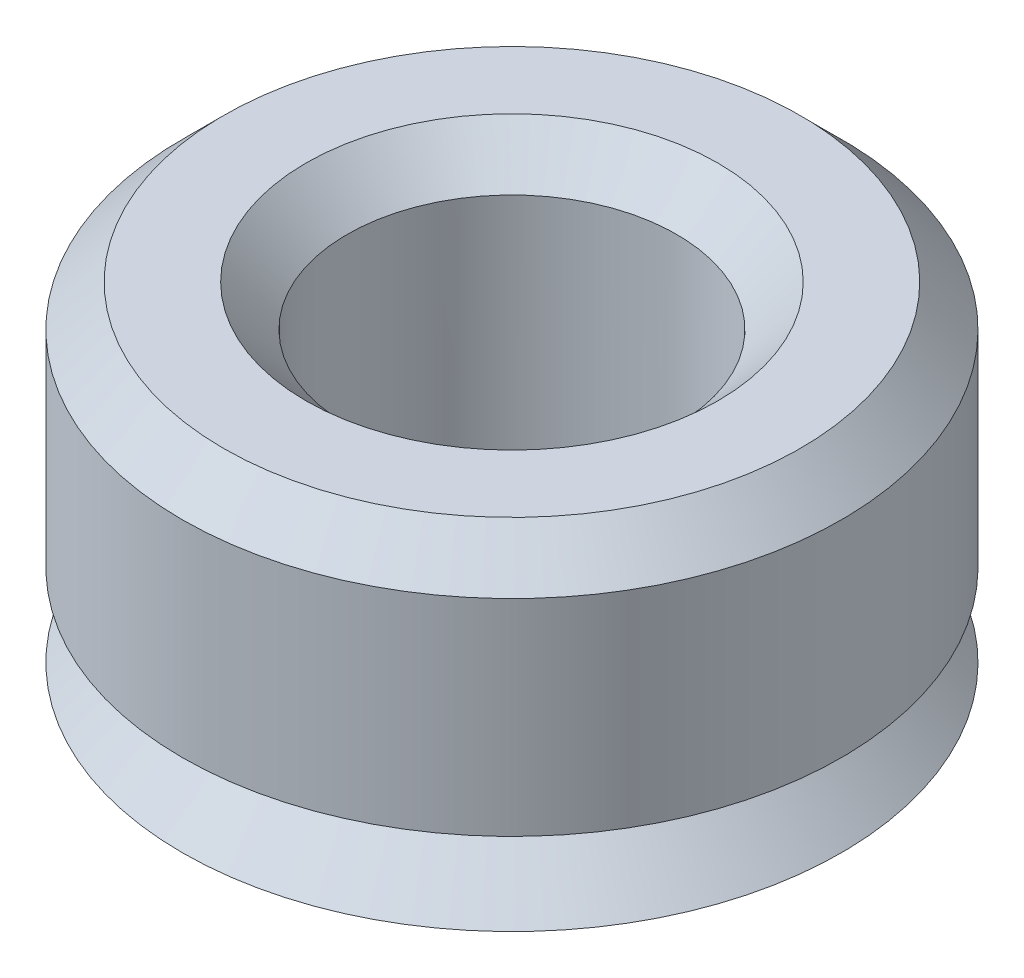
from build123d import *

# Parameters (mm, degrees)
CHAMFER1_SIZE = 0.5


with BuildPart() as part:
    # Sketch1 → Revolve1 (revolve)
    with BuildSketch(Plane(origin=(0, 0, 0), x_dir=(0, 0, -1), z_dir=(1, 0, 0))):
        Polygon((-2, 0), (-2, 4), (-4, 4), (-4, 1), (-3, 1), (-4, 0), align=None)
    revolve(axis=Axis((0, 0, 0), (0, -1, 0)))

    # Chamfer1
    chamfer1_edges = [part.edges().sort_by_distance(p)[0] for p in [
        (0, 0, -2),
        (0, 4, -2),
        (0, 4, -4),
    ]]
    chamfer(chamfer1_edges, length=CHAMFER1_SIZE)


solid = part.part
